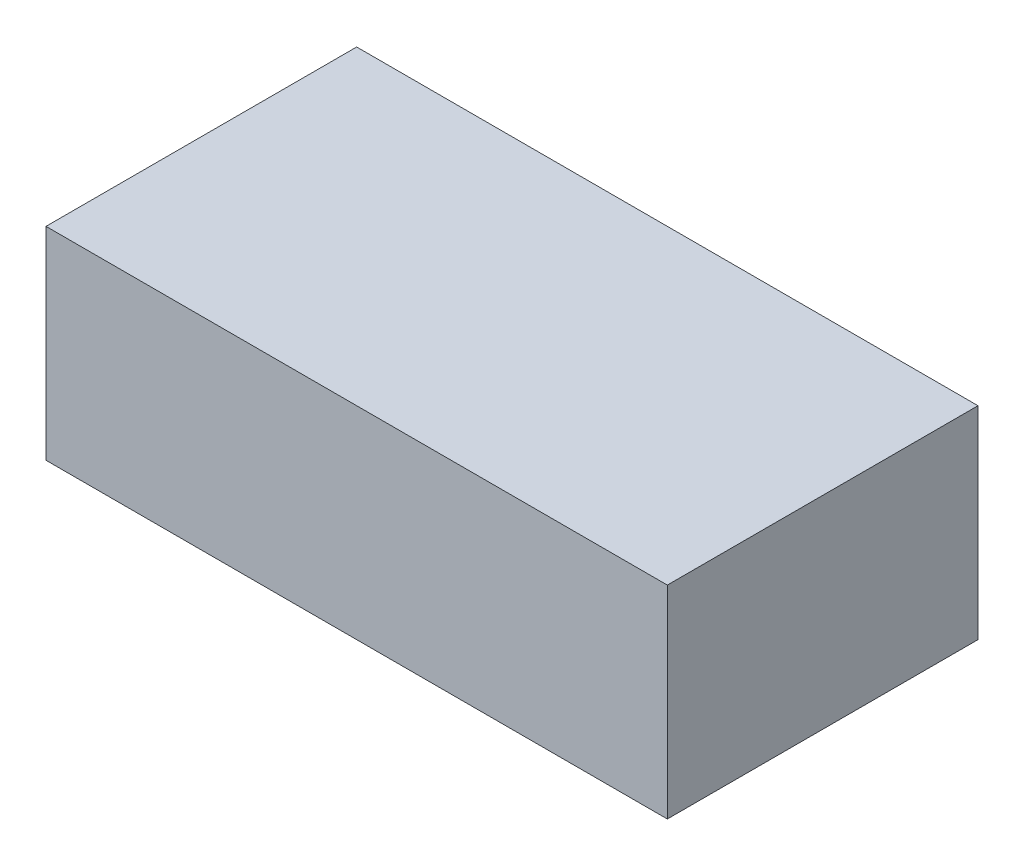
from build123d import *

# Parameters (mm, degrees)
SKETCH1_W           = 230
SKETCH1_H           = 115
BOSS_EXTRUDE1_DEPTH = 37.5


with BuildPart() as part:
    # Sketch1 → Boss-Extrude1 (new, symmetric)
    with BuildSketch(Plane(origin=(0, 0, 0), x_dir=(1, 0, 0), z_dir=(0, 1, 0))):
        Rectangle(SKETCH1_W, SKETCH1_H)
    extrude(amount=BOSS_EXTRUDE1_DEPTH, both=True)


solid = part.part
